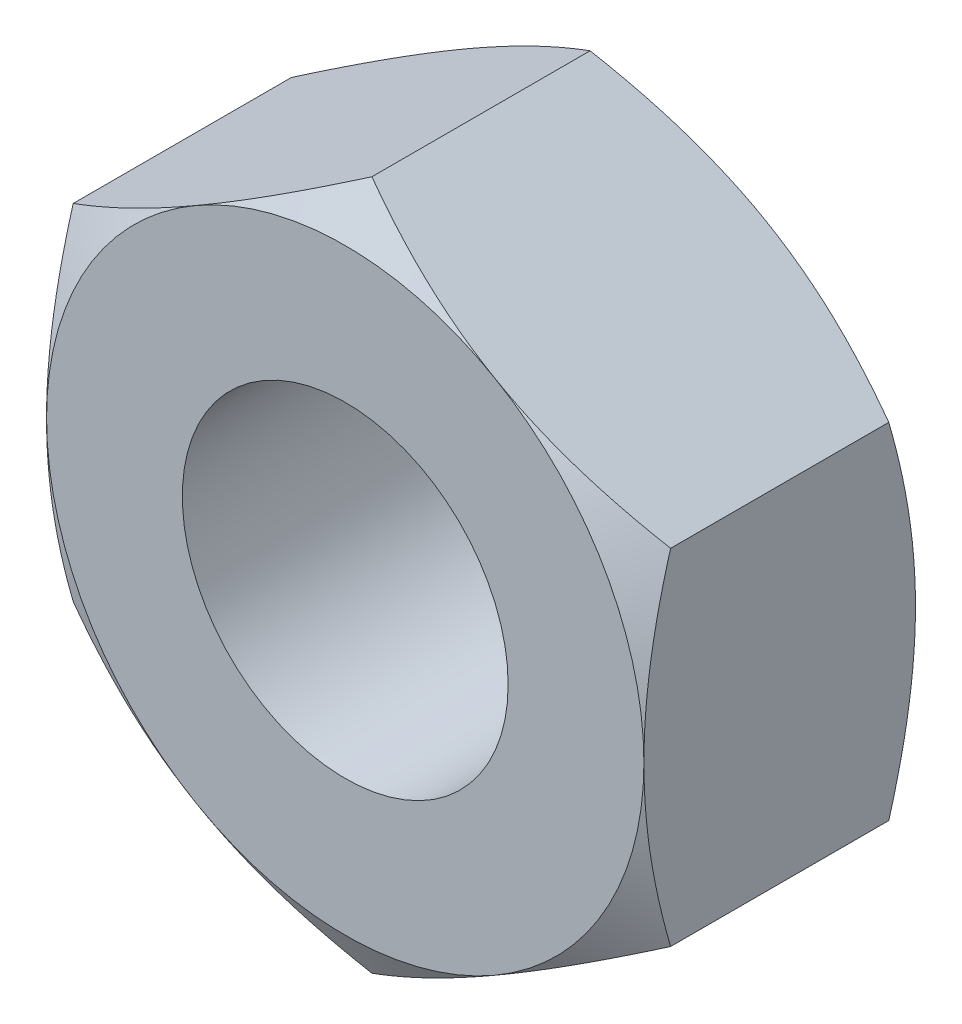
ISO-10303-21;
HEADER;
FILE_DESCRIPTION(('STEP AP214'),'2;1');
FILE_NAME('part.step','',(''),(''),'','','');
FILE_SCHEMA(('AUTOMOTIVE_DESIGN { 1 0 10303 214 1 1 1 1 }'));
ENDSEC;
DATA;
#1=APPLICATION_CONTEXT('core data for automotive mechanical design processes');
#2=APPLICATION_PROTOCOL_DEFINITION('international standard','automotive_design',2000,#1);
#3=PRODUCT_CONTEXT('',#1,'mechanical');
#4=PRODUCT('Part','Part','',(#3));
#5=PRODUCT_RELATED_PRODUCT_CATEGORY('part','',(#4));
#6=PRODUCT_DEFINITION_FORMATION('','',#4);
#7=PRODUCT_DEFINITION_CONTEXT('part definition',#1,'design');
#8=PRODUCT_DEFINITION('design','',#6,#7);
#9=PRODUCT_DEFINITION_SHAPE('','',#8);
#10=(LENGTH_UNIT() NAMED_UNIT(*) SI_UNIT(.MILLI.,.METRE.));
#11=(NAMED_UNIT(*) PLANE_ANGLE_UNIT() SI_UNIT($,.RADIAN.));
#12=(NAMED_UNIT(*) SI_UNIT($,.STERADIAN.) SOLID_ANGLE_UNIT());
#13=UNCERTAINTY_MEASURE_WITH_UNIT(LENGTH_MEASURE(1.E-05),#10,'distance_accuracy_value','');
#14=(GEOMETRIC_REPRESENTATION_CONTEXT(3) GLOBAL_UNCERTAINTY_ASSIGNED_CONTEXT((#13)) GLOBAL_UNIT_ASSIGNED_CONTEXT((#10,
#11,#12)) REPRESENTATION_CONTEXT('',''));
#15=CARTESIAN_POINT('',(0.,0.,0.));
#16=DIRECTION('',(0.,0.,1.));
#17=DIRECTION('',(1.,0.,0.));
#18=AXIS2_PLACEMENT_3D('',#15,#16,#17);
#19=CARTESIAN_POINT('',(-5.50000000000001,9.52627944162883,0.));
#20=DIRECTION('',(0.,0.,-1.));
#21=DIRECTION('',(-1.,0.,0.));
#22=AXIS2_PLACEMENT_3D('',#19,#20,#21);
#23=PLANE('',#22);
#24=CARTESIAN_POINT('',(0.,0.,0.));
#25=DIRECTION('',(0.,0.,1.));
#26=DIRECTION('',(1.,0.,0.));
#27=AXIS2_PLACEMENT_3D('',#24,#25,#26);
#28=CIRCLE('',#27,3.);
#29=CARTESIAN_POINT('',(3.,0.,0.));
#30=VERTEX_POINT('',#29);
#31=EDGE_CURVE('E312',#30,#30,#28,.T.);
#32=ORIENTED_EDGE('',*,*,#31,.F.);
#33=EDGE_LOOP('',(#32));
#34=FACE_BOUND('',#33,.T.);
#35=CARTESIAN_POINT('',(0.,0.,0.));
#36=DIRECTION('',(0.,0.,-1.));
#37=DIRECTION('',(-1.,0.,0.));
#38=AXIS2_PLACEMENT_3D('',#35,#36,#37);
#39=CIRCLE('',#38,5.5);
#40=CARTESIAN_POINT('',(-5.50000000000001,0.,0.));
#41=VERTEX_POINT('',#40);
#42=CARTESIAN_POINT('',(-2.75,4.76313972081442,0.));
#43=VERTEX_POINT('',#42);
#44=EDGE_CURVE('E320',#41,#43,#39,.T.);
#45=ORIENTED_EDGE('',*,*,#44,.F.);
#46=CARTESIAN_POINT('',(0.,0.,0.));
#47=DIRECTION('',(0.,0.,-1.));
#48=DIRECTION('',(-1.,0.,0.));
#49=AXIS2_PLACEMENT_3D('',#46,#47,#48);
#50=CIRCLE('',#49,5.5);
#51=CARTESIAN_POINT('',(-2.75,-4.76313972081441,0.));
#52=VERTEX_POINT('',#51);
#53=EDGE_CURVE('E141',#41,#52,#50,.F.);
#54=ORIENTED_EDGE('',*,*,#53,.T.);
#55=CARTESIAN_POINT('',(2.75,-4.76313972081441,0.));
#56=VERTEX_POINT('',#55);
#57=EDGE_CURVE('E243',#52,#56,#50,.F.);
#58=ORIENTED_EDGE('',*,*,#57,.T.);
#59=CARTESIAN_POINT('',(5.50000000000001,0.,0.));
#60=VERTEX_POINT('',#59);
#61=EDGE_CURVE('E144',#56,#60,#50,.F.);
#62=ORIENTED_EDGE('',*,*,#61,.T.);
#63=CARTESIAN_POINT('',(2.75,4.76313972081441,0.));
#64=VERTEX_POINT('',#63);
#65=EDGE_CURVE('E119',#60,#64,#50,.F.);
#66=ORIENTED_EDGE('',*,*,#65,.T.);
#67=EDGE_CURVE('E132',#64,#43,#50,.F.);
#68=ORIENTED_EDGE('',*,*,#67,.T.);
#69=EDGE_LOOP('',(#45,#54,#58,#62,#66,#68));
#70=FACE_BOUND('',#69,.T.);
#71=ADVANCED_FACE('F24',(#34,#70),#23,.F.);
#72=CARTESIAN_POINT('',(0.,0.,0.));
#73=DIRECTION('',(0.,0.,-1.));
#74=DIRECTION('',(-1.,0.,0.));
#75=AXIS2_PLACEMENT_3D('',#72,#73,#74);
#76=CONICAL_SURFACE('',#75,5.5,1.0471975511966);
#77=CARTESIAN_POINT('',(-5.50000000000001,-8.70351799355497,-2.76879271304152));
#78=CARTESIAN_POINT('',(-5.50000000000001,-8.46178904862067,-2.65084369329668));
#79=CARTESIAN_POINT('',(-5.50000000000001,-8.21952354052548,-2.5339763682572));
#80=CARTESIAN_POINT('',(-5.50000000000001,-7.73363470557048,-2.30301016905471));
#81=CARTESIAN_POINT('',(-5.50000000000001,-7.49001118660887,-2.18891169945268));
#82=CARTESIAN_POINT('',(-5.50000000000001,-6.99994766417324,-1.96355080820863));
#83=CARTESIAN_POINT('',(-5.50000000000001,-6.75349963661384,-1.85230577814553));
#84=CARTESIAN_POINT('',(-5.50000000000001,-6.2587033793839,-1.63414148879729));
#85=CARTESIAN_POINT('',(-5.50000000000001,-6.01035523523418,-1.52722203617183));
#86=CARTESIAN_POINT('',(-5.50000000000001,-5.50269627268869,-1.31522542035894));
#87=CARTESIAN_POINT('',(-5.50000000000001,-5.24330438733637,-1.21034137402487));
#88=CARTESIAN_POINT('',(-5.50000000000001,-4.72155044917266,-1.00809836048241));
#89=CARTESIAN_POINT('',(-5.50000000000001,-4.45918807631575,-0.910740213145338));
#90=CARTESIAN_POINT('',(-5.50000000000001,-3.93151422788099,-0.725978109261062));
#91=CARTESIAN_POINT('',(-5.50000000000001,-3.666209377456,-0.638555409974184));
#92=CARTESIAN_POINT('',(-5.50000000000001,-3.13179456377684,-0.476354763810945));
#93=CARTESIAN_POINT('',(-5.50000000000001,-2.8626857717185,-0.401573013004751));
#94=CARTESIAN_POINT('',(-5.50000000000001,-2.3220590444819,-0.268532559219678));
#95=CARTESIAN_POINT('',(-5.50000000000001,-2.05056513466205,-0.210177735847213));
#96=CARTESIAN_POINT('',(-5.50000000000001,-1.50398696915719,-0.113169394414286));
#97=CARTESIAN_POINT('',(-5.50000000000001,-1.22890310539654,-0.0745137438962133));
#98=CARTESIAN_POINT('',(-5.50000000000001,-0.816510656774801,-0.0338614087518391));
#99=CARTESIAN_POINT('',(-5.50000000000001,-0.680022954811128,-0.0232143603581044));
#100=CARTESIAN_POINT('',(-5.50000000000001,-0.406723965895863,-0.00770408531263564));
#101=CARTESIAN_POINT('',(-5.50000000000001,-0.269912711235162,-0.00284030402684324));
#102=CARTESIAN_POINT('',(-5.50000000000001,0.00380270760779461,0.000982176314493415));
#103=CARTESIAN_POINT('',(-5.50000000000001,0.140706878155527,-5.95812088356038E-05));
#104=CARTESIAN_POINT('',(-5.50000000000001,0.414334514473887,-0.00802004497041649));
#105=CARTESIAN_POINT('',(-5.50000000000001,0.551057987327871,-0.0149385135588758));
#106=CARTESIAN_POINT('',(-5.50000000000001,0.874535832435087,-0.0381092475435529));
#107=CARTESIAN_POINT('',(-5.50000000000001,1.06111508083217,-0.0568653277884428));
#108=CARTESIAN_POINT('',(-5.50000000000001,1.43299199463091,-0.104336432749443));
#109=CARTESIAN_POINT('',(-5.50000000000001,1.61828950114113,-0.133052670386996));
#110=CARTESIAN_POINT('',(-5.50000000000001,2.1719900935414,-0.23262759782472));
#111=CARTESIAN_POINT('',(-5.50000000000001,2.53801909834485,-0.316897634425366));
#112=CARTESIAN_POINT('',(-5.50000000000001,3.08556978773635,-0.46434516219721));
#113=CARTESIAN_POINT('',(-5.50000000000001,3.26989484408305,-0.51772313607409));
#114=CARTESIAN_POINT('',(-5.50000000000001,3.63675886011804,-0.630354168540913));
#115=CARTESIAN_POINT('',(-5.50000000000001,3.81929780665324,-0.689607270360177));
#116=CARTESIAN_POINT('',(-5.50000000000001,4.1826407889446,-0.813010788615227));
#117=CARTESIAN_POINT('',(-5.50000000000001,4.3634452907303,-0.877159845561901));
#118=CARTESIAN_POINT('',(-5.50000000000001,4.72353439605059,-1.00956774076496));
#119=CARTESIAN_POINT('',(-5.50000000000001,4.90281902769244,-1.07782650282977));
#120=CARTESIAN_POINT('',(-5.50000000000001,5.3614641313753,-1.25751437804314));
#121=CARTESIAN_POINT('',(-5.50000000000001,5.63984228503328,-1.37144768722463));
#122=CARTESIAN_POINT('',(-5.50000000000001,6.19388947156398,-1.60574322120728));
#123=CARTESIAN_POINT('',(-5.50000000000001,6.46955825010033,-1.72610604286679));
#124=CARTESIAN_POINT('',(-5.50000000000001,7.01875943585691,-1.97183385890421));
#125=CARTESIAN_POINT('',(-5.50000000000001,7.29229110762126,-2.09720049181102));
#126=CARTESIAN_POINT('',(-5.50000000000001,7.83752606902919,-2.35181333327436));
#127=CARTESIAN_POINT('',(-5.50000000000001,8.10922941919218,-2.481059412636));
#128=CARTESIAN_POINT('',(-5.50000000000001,8.65153958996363,-2.74282128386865));
#129=CARTESIAN_POINT('',(-5.50000000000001,8.92214424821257,-2.87534154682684));
#130=CARTESIAN_POINT('',(-5.50000000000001,9.46212230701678,-3.14286981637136));
#131=CARTESIAN_POINT('',(-5.50000000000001,9.73149569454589,-3.27787784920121));
#132=CARTESIAN_POINT('',(-5.50000000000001,10.5379884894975,-3.68585796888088));
#133=CARTESIAN_POINT('',(-5.50000000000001,11.0735860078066,-3.96183747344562));
#134=CARTESIAN_POINT('',(-5.50000000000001,12.0898316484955,-4.49207617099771));
#135=CARTESIAN_POINT('',(-5.50000000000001,12.5707451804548,-4.7458291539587));
#136=CARTESIAN_POINT('',(-5.50000000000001,13.5308468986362,-5.25663670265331));
#137=CARTESIAN_POINT('',(-5.50000000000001,14.0100349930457,-5.51369144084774));
#138=CARTESIAN_POINT('',(-5.50000000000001,14.9655711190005,-6.02945598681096));
#139=CARTESIAN_POINT('',(-5.50000000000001,15.4419233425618,-6.28815804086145));
#140=CARTESIAN_POINT('',(-5.50000000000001,16.3935427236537,-6.80747025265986));
#141=CARTESIAN_POINT('',(-5.50000000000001,16.8688099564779,-7.06808027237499));
#142=CARTESIAN_POINT('',(-5.50000000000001,17.343689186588,-7.32939074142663));
#143=B_SPLINE_CURVE_WITH_KNOTS('',3,(#77,#78,#79,#80,#81,#82,#83,#84,#85,#86,#87,#88,#89,#90,
#91,#92,#93,#94,#95,#96,#97,#98,#99,#100,#101,#102,#103,#104,#105,#106,#107,#108,#109,#110,#111,
#112,#113,#114,#115,#116,#117,#118,#119,#120,#121,#122,#123,#124,#125,#126,#127,#128,#129,#130,
#131,#132,#133,#134,#135,#136,#137,#138,#139,#140,#141,#142),.UNSPECIFIED.,.F.,.F.,(4,2,2,2,2,2,
2,2,2,2,2,2,2,2,2,2,2,2,2,2,2,2,2,2,2,2,2,2,2,2,2,2,4),(0.,0.806919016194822,1.61395523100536,
2.42509926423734,3.23620700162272,4.07549945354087,4.91488320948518,5.7526562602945,
6.59017675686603,7.42268958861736,8.25511228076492,8.66571545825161,9.07627925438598,
9.48687479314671,9.89745372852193,10.4596985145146,11.0220117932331,12.1471841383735,
12.7228259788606,13.2984720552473,13.873958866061,14.4494350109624,15.3516919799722,
16.2540328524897,17.1566716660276,18.0592804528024,18.9631985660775,19.8671262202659,
21.6746295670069,23.3058782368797,24.937212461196,26.5634131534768,28.1894973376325),.UNSPECIFIED.);
#144=CARTESIAN_POINT('',(-5.50000000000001,3.17542648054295,-0.491240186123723));
#145=VERTEX_POINT('',#144);
#146=EDGE_CURVE('E149',#145,#41,#143,.F.);
#147=ORIENTED_EDGE('',*,*,#146,.T.);
#148=ORIENTED_EDGE('',*,*,#44,.T.);
#149=CARTESIAN_POINT('',(0.000200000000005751,6.35096843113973,-0.491306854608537));
#150=CARTESIAN_POINT('',(-0.120696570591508,6.28116876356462,-0.451013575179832));
#151=CARTESIAN_POINT('',(-0.2420439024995,6.21110884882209,-0.412548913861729));
#152=CARTESIAN_POINT('',(-0.485724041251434,6.0704200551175,-0.3397804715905));
#153=CARTESIAN_POINT('',(-0.608057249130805,5.99979094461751,-0.305478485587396));
#154=CARTESIAN_POINT('',(-0.977015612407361,5.78677273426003,-0.209489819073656));
#155=CARTESIAN_POINT('',(-1.2250971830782,5.64354277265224,-0.154892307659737));
#156=CARTESIAN_POINT('',(-1.59634674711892,5.42920173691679,-0.0908698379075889));
#157=CARTESIAN_POINT('',(-1.71840546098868,5.35873110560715,-0.0726315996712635));
#158=CARTESIAN_POINT('',(-1.96307442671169,5.21747141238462,-0.0420485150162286));
#159=CARTESIAN_POINT('',(-2.08568462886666,5.14668237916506,-0.0297031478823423));
#160=CARTESIAN_POINT('',(-2.3311179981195,5.00498135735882,-0.0112204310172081));
#161=CARTESIAN_POINT('',(-2.45394076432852,4.93406960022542,-0.00507603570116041));
#162=CARTESIAN_POINT('',(-2.6996929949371,4.7921844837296,0.000879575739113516));
#163=CARTESIAN_POINT('',(-2.82262245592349,4.72121112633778,0.000690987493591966));
#164=CARTESIAN_POINT('',(-3.15941408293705,4.52676438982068,-0.00853091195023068));
#165=CARTESIAN_POINT('',(-3.37316601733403,4.40335465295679,-0.0240139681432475));
#166=CARTESIAN_POINT('',(-3.79925015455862,4.15735486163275,-0.0731121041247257));
#167=CARTESIAN_POINT('',(-4.01158085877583,4.03476567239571,-0.106743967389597));
#168=CARTESIAN_POINT('',(-4.43852257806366,3.7882707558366,-0.190814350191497));
#169=CARTESIAN_POINT('',(-4.65307971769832,3.66439613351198,-0.241609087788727));
#170=CARTESIAN_POINT('',(-5.07899423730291,3.4184942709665,-0.356892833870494));
#171=CARTESIAN_POINT('',(-5.29035707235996,3.29646388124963,-0.421354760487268));
#172=CARTESIAN_POINT('',(-5.50020000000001,3.17531101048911,-0.491306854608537));
#173=B_SPLINE_CURVE_WITH_KNOTS('',3,(#149,#150,#151,#152,#153,#154,#155,#156,#157,#158,#159,
#160,#161,#162,#163,#164,#165,#166,#167,#168,#169,#170,#171,#172),.UNSPECIFIED.,.F.,.F.,(4,2,2,
2,2,2,2,2,2,2,2,4),(0.,0.435859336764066,0.871905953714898,1.74581116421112,2.17206086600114,
2.59827289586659,3.02400011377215,3.44971418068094,4.19085033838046,4.93267305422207,
5.69094899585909,6.44773620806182),.UNSPECIFIED.);
#174=EDGE_CURVE('E181',#43,#145,#173,.T.);
#175=ORIENTED_EDGE('',*,*,#174,.T.);
#176=EDGE_LOOP('',(#147,#148,#175));
#177=FACE_BOUND('',#176,.T.);
#178=ADVANCED_FACE('F168',(#177),#76,.T.);
#179=CARTESIAN_POINT('',(5.50020000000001,3.17531101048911,-0.491306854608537));
#180=CARTESIAN_POINT('',(5.37930342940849,3.24511067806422,-0.451013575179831));
#181=CARTESIAN_POINT('',(5.2579560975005,3.31517059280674,-0.412548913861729));
#182=CARTESIAN_POINT('',(5.01427595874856,3.45585938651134,-0.339780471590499));
#183=CARTESIAN_POINT('',(4.89194275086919,3.52648849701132,-0.305478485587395));
#184=CARTESIAN_POINT('',(4.52298438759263,3.73950670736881,-0.209489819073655));
#185=CARTESIAN_POINT('',(4.27490281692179,3.88273666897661,-0.154892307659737));
#186=CARTESIAN_POINT('',(3.90365325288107,4.09707770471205,-0.0908698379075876));
#187=CARTESIAN_POINT('',(3.78159453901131,4.16754833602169,-0.072631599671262));
#188=CARTESIAN_POINT('',(3.53692557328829,4.30880802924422,-0.042048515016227));
#189=CARTESIAN_POINT('',(3.41431537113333,4.37959706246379,-0.0297031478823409));
#190=CARTESIAN_POINT('',(3.16888200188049,4.52129808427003,-0.0112204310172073));
#191=CARTESIAN_POINT('',(3.04605923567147,4.59220984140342,-0.00507603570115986));
#192=CARTESIAN_POINT('',(2.80030700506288,4.73409495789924,0.000879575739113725));
#193=CARTESIAN_POINT('',(2.67737754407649,4.80506831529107,0.000690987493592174));
#194=CARTESIAN_POINT('',(2.34058591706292,4.99951505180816,-0.00853091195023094));
#195=CARTESIAN_POINT('',(2.12683398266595,5.12292478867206,-0.0240139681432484));
#196=CARTESIAN_POINT('',(1.70074984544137,5.3689245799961,-0.0731121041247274));
#197=CARTESIAN_POINT('',(1.48841914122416,5.49151376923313,-0.106743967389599));
#198=CARTESIAN_POINT('',(1.06147742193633,5.73800868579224,-0.190814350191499));
#199=CARTESIAN_POINT('',(0.846920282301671,5.86188330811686,-0.241609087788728));
#200=CARTESIAN_POINT('',(0.421005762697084,6.10778517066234,-0.356892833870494));
#201=CARTESIAN_POINT('',(0.209642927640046,6.22981556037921,-0.421354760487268));
#202=CARTESIAN_POINT('',(-0.000200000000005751,6.35096843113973,-0.491306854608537));
#203=B_SPLINE_CURVE_WITH_KNOTS('',3,(#179,#180,#181,#182,#183,#184,#185,#186,#187,#188,#189,
#190,#191,#192,#193,#194,#195,#196,#197,#198,#199,#200,#201,#202),.UNSPECIFIED.,.F.,.F.,(4,2,2,
2,2,2,2,2,2,2,2,4),(0.,0.435859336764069,0.871905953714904,1.74581116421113,2.17206086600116,
2.59827289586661,3.02400011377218,3.44971418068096,4.19085033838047,4.93267305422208,
5.6909489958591,6.44773620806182),.UNSPECIFIED.);
#204=CARTESIAN_POINT('',(0.,6.35085296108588,-0.491240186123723));
#205=VERTEX_POINT('',#204);
#206=EDGE_CURVE('E128',#64,#205,#203,.T.);
#207=ORIENTED_EDGE('',*,*,#206,.T.);
#208=EDGE_CURVE('E135',#205,#43,#173,.T.);
#209=ORIENTED_EDGE('',*,*,#208,.T.);
#210=ORIENTED_EDGE('',*,*,#67,.F.);
#211=EDGE_LOOP('',(#207,#209,#210));
#212=FACE_BOUND('',#211,.T.);
#213=ADVANCED_FACE('F133',(#212),#76,.T.);
#214=CARTESIAN_POINT('',(5.50000000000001,-8.70351799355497,-2.76879271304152));
#215=CARTESIAN_POINT('',(5.50000000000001,-8.46178904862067,-2.65084369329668));
#216=CARTESIAN_POINT('',(5.50000000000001,-8.21952354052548,-2.5339763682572));
#217=CARTESIAN_POINT('',(5.50000000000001,-7.73363470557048,-2.30301016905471));
#218=CARTESIAN_POINT('',(5.50000000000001,-7.49001118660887,-2.18891169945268));
#219=CARTESIAN_POINT('',(5.50000000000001,-6.99994766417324,-1.96355080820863));
#220=CARTESIAN_POINT('',(5.50000000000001,-6.75349963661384,-1.85230577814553));
#221=CARTESIAN_POINT('',(5.50000000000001,-6.2587033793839,-1.63414148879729));
#222=CARTESIAN_POINT('',(5.50000000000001,-6.01035523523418,-1.52722203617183));
#223=CARTESIAN_POINT('',(5.50000000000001,-5.50269627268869,-1.31522542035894));
#224=CARTESIAN_POINT('',(5.50000000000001,-5.24330438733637,-1.21034137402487));
#225=CARTESIAN_POINT('',(5.50000000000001,-4.72155044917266,-1.00809836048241));
#226=CARTESIAN_POINT('',(5.50000000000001,-4.45918807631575,-0.910740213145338));
#227=CARTESIAN_POINT('',(5.50000000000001,-3.93151422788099,-0.725978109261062));
#228=CARTESIAN_POINT('',(5.50000000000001,-3.666209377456,-0.638555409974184));
#229=CARTESIAN_POINT('',(5.50000000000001,-3.13179456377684,-0.476354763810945));
#230=CARTESIAN_POINT('',(5.50000000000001,-2.8626857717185,-0.401573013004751));
#231=CARTESIAN_POINT('',(5.50000000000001,-2.3220590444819,-0.268532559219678));
#232=CARTESIAN_POINT('',(5.50000000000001,-2.05056513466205,-0.210177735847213));
#233=CARTESIAN_POINT('',(5.50000000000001,-1.50398696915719,-0.113169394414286));
#234=CARTESIAN_POINT('',(5.50000000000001,-1.22890310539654,-0.0745137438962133));
#235=CARTESIAN_POINT('',(5.50000000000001,-0.816510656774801,-0.0338614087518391));
#236=CARTESIAN_POINT('',(5.50000000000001,-0.680022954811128,-0.0232143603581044));
#237=CARTESIAN_POINT('',(5.50000000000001,-0.406723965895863,-0.00770408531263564));
#238=CARTESIAN_POINT('',(5.50000000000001,-0.269912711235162,-0.00284030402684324));
#239=CARTESIAN_POINT('',(5.50000000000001,0.00380270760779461,0.000982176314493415));
#240=CARTESIAN_POINT('',(5.50000000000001,0.140706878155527,-5.95812088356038E-05));
#241=CARTESIAN_POINT('',(5.50000000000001,0.414334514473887,-0.00802004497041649));
#242=CARTESIAN_POINT('',(5.50000000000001,0.551057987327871,-0.0149385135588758));
#243=CARTESIAN_POINT('',(5.50000000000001,0.874535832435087,-0.0381092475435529));
#244=CARTESIAN_POINT('',(5.50000000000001,1.06111508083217,-0.0568653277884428));
#245=CARTESIAN_POINT('',(5.50000000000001,1.43299199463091,-0.104336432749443));
#246=CARTESIAN_POINT('',(5.50000000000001,1.61828950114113,-0.133052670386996));
#247=CARTESIAN_POINT('',(5.50000000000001,2.1719900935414,-0.23262759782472));
#248=CARTESIAN_POINT('',(5.50000000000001,2.53801909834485,-0.316897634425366));
#249=CARTESIAN_POINT('',(5.50000000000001,3.08556978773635,-0.46434516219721));
#250=CARTESIAN_POINT('',(5.50000000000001,3.26989484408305,-0.51772313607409));
#251=CARTESIAN_POINT('',(5.50000000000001,3.63675886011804,-0.630354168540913));
#252=CARTESIAN_POINT('',(5.50000000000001,3.81929780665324,-0.689607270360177));
#253=CARTESIAN_POINT('',(5.50000000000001,4.1826407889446,-0.813010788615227));
#254=CARTESIAN_POINT('',(5.50000000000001,4.3634452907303,-0.877159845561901));
#255=CARTESIAN_POINT('',(5.50000000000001,4.72353439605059,-1.00956774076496));
#256=CARTESIAN_POINT('',(5.50000000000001,4.90281902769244,-1.07782650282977));
#257=CARTESIAN_POINT('',(5.50000000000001,5.3614641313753,-1.25751437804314));
#258=CARTESIAN_POINT('',(5.50000000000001,5.63984228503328,-1.37144768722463));
#259=CARTESIAN_POINT('',(5.50000000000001,6.19388947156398,-1.60574322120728));
#260=CARTESIAN_POINT('',(5.50000000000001,6.46955825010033,-1.72610604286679));
#261=CARTESIAN_POINT('',(5.50000000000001,7.01875943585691,-1.97183385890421));
#262=CARTESIAN_POINT('',(5.50000000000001,7.29229110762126,-2.09720049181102));
#263=CARTESIAN_POINT('',(5.50000000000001,7.83752606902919,-2.35181333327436));
#264=CARTESIAN_POINT('',(5.50000000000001,8.10922941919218,-2.481059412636));
#265=CARTESIAN_POINT('',(5.50000000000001,8.65153958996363,-2.74282128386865));
#266=CARTESIAN_POINT('',(5.50000000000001,8.92214424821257,-2.87534154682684));
#267=CARTESIAN_POINT('',(5.50000000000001,9.46212230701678,-3.14286981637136));
#268=CARTESIAN_POINT('',(5.50000000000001,9.73149569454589,-3.27787784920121));
#269=CARTESIAN_POINT('',(5.50000000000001,10.5379884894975,-3.68585796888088));
#270=CARTESIAN_POINT('',(5.50000000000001,11.0735860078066,-3.96183747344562));
#271=CARTESIAN_POINT('',(5.50000000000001,12.0898316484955,-4.49207617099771));
#272=CARTESIAN_POINT('',(5.50000000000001,12.5707451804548,-4.7458291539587));
#273=CARTESIAN_POINT('',(5.50000000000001,13.5308468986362,-5.25663670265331));
#274=CARTESIAN_POINT('',(5.50000000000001,14.0100349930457,-5.51369144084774));
#275=CARTESIAN_POINT('',(5.50000000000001,14.9655711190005,-6.02945598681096));
#276=CARTESIAN_POINT('',(5.50000000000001,15.4419233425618,-6.28815804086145));
#277=CARTESIAN_POINT('',(5.50000000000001,16.3935427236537,-6.80747025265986));
#278=CARTESIAN_POINT('',(5.50000000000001,16.8688099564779,-7.06808027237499));
#279=CARTESIAN_POINT('',(5.50000000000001,17.343689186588,-7.32939074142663));
#280=B_SPLINE_CURVE_WITH_KNOTS('',3,(#214,#215,#216,#217,#218,#219,#220,#221,#222,#223,#224,
#225,#226,#227,#228,#229,#230,#231,#232,#233,#234,#235,#236,#237,#238,#239,#240,#241,#242,#243,
#244,#245,#246,#247,#248,#249,#250,#251,#252,#253,#254,#255,#256,#257,#258,#259,#260,#261,#262,
#263,#264,#265,#266,#267,#268,#269,#270,#271,#272,#273,#274,#275,#276,#277,#278,#279),
.UNSPECIFIED.,.F.,.F.,(4,2,2,2,2,2,2,2,2,2,2,2,2,2,2,2,2,2,2,2,2,2,2,2,2,2,2,2,2,2,2,2,4),(0.,
0.806919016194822,1.61395523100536,2.42509926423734,3.23620700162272,4.07549945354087,
4.91488320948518,5.7526562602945,6.59017675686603,7.42268958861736,8.25511228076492,
8.66571545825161,9.07627925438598,9.48687479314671,9.89745372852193,10.4596985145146,
11.0220117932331,12.1471841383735,12.7228259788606,13.2984720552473,13.873958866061,
14.4494350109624,15.3516919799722,16.2540328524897,17.1566716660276,18.0592804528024,
18.9631985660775,19.8671262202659,21.6746295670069,23.3058782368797,24.937212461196,
26.5634131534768,28.1894973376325),.UNSPECIFIED.);
#281=CARTESIAN_POINT('',(5.50000000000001,3.17542648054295,-0.491240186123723));
#282=VERTEX_POINT('',#281);
#283=EDGE_CURVE('E122',#60,#282,#280,.T.);
#284=ORIENTED_EDGE('',*,*,#283,.T.);
#285=EDGE_CURVE('E115',#282,#64,#203,.T.);
#286=ORIENTED_EDGE('',*,*,#285,.T.);
#287=ORIENTED_EDGE('',*,*,#65,.F.);
#288=EDGE_LOOP('',(#284,#286,#287));
#289=FACE_BOUND('',#288,.T.);
#290=ADVANCED_FACE('F117',(#289),#76,.T.);
#291=CARTESIAN_POINT('',(-0.000200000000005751,-6.35096843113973,-0.491306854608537));
#292=CARTESIAN_POINT('',(0.120696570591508,-6.28116876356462,-0.451013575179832));
#293=CARTESIAN_POINT('',(0.2420439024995,-6.21110884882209,-0.412548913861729));
#294=CARTESIAN_POINT('',(0.485724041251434,-6.0704200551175,-0.3397804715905));
#295=CARTESIAN_POINT('',(0.608057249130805,-5.99979094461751,-0.305478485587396));
#296=CARTESIAN_POINT('',(0.977015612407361,-5.78677273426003,-0.209489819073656));
#297=CARTESIAN_POINT('',(1.2250971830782,-5.64354277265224,-0.154892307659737));
#298=CARTESIAN_POINT('',(1.59634674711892,-5.42920173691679,-0.0908698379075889));
#299=CARTESIAN_POINT('',(1.71840546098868,-5.35873110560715,-0.0726315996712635));
#300=CARTESIAN_POINT('',(1.96307442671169,-5.21747141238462,-0.0420485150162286));
#301=CARTESIAN_POINT('',(2.08568462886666,-5.14668237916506,-0.0297031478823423));
#302=CARTESIAN_POINT('',(2.3311179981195,-5.00498135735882,-0.0112204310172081));
#303=CARTESIAN_POINT('',(2.45394076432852,-4.93406960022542,-0.00507603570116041));
#304=CARTESIAN_POINT('',(2.6996929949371,-4.7921844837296,0.000879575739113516));
#305=CARTESIAN_POINT('',(2.82262245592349,-4.72121112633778,0.000690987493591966));
#306=CARTESIAN_POINT('',(3.15941408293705,-4.52676438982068,-0.00853091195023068));
#307=CARTESIAN_POINT('',(3.37316601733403,-4.40335465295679,-0.0240139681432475));
#308=CARTESIAN_POINT('',(3.79925015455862,-4.15735486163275,-0.0731121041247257));
#309=CARTESIAN_POINT('',(4.01158085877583,-4.03476567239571,-0.106743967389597));
#310=CARTESIAN_POINT('',(4.43852257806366,-3.7882707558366,-0.190814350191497));
#311=CARTESIAN_POINT('',(4.65307971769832,-3.66439613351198,-0.241609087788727));
#312=CARTESIAN_POINT('',(5.07899423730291,-3.4184942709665,-0.356892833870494));
#313=CARTESIAN_POINT('',(5.29035707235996,-3.29646388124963,-0.421354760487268));
#314=CARTESIAN_POINT('',(5.50020000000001,-3.17531101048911,-0.491306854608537));
#315=B_SPLINE_CURVE_WITH_KNOTS('',3,(#291,#292,#293,#294,#295,#296,#297,#298,#299,#300,#301,
#302,#303,#304,#305,#306,#307,#308,#309,#310,#311,#312,#313,#314),.UNSPECIFIED.,.F.,.F.,(4,2,2,
2,2,2,2,2,2,2,2,4),(0.,0.435859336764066,0.871905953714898,1.74581116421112,2.17206086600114,
2.59827289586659,3.02400011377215,3.44971418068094,4.19085033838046,4.93267305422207,
5.69094899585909,6.44773620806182),.UNSPECIFIED.);
#316=CARTESIAN_POINT('',(5.50000000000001,-3.17542648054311,-0.491240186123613));
#317=VERTEX_POINT('',#316);
#318=EDGE_CURVE('E195',#56,#317,#315,.T.);
#319=ORIENTED_EDGE('',*,*,#318,.T.);
#320=EDGE_CURVE('E194',#317,#60,#280,.T.);
#321=ORIENTED_EDGE('',*,*,#320,.T.);
#322=ORIENTED_EDGE('',*,*,#61,.F.);
#323=EDGE_LOOP('',(#319,#321,#322));
#324=FACE_BOUND('',#323,.T.);
#325=ADVANCED_FACE('F370',(#324),#76,.T.);
#326=CARTESIAN_POINT('',(0.,-6.35085296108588,-0.491240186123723));
#327=VERTEX_POINT('',#326);
#328=EDGE_CURVE('E253',#327,#56,#315,.T.);
#329=ORIENTED_EDGE('',*,*,#328,.T.);
#330=ORIENTED_EDGE('',*,*,#57,.F.);
#331=CARTESIAN_POINT('',(-5.50020000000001,-3.17531101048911,-0.491306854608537));
#332=CARTESIAN_POINT('',(-5.37930342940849,-3.24511067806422,-0.451013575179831));
#333=CARTESIAN_POINT('',(-5.2579560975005,-3.31517059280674,-0.412548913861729));
#334=CARTESIAN_POINT('',(-5.01427595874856,-3.45585938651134,-0.339780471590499));
#335=CARTESIAN_POINT('',(-4.89194275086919,-3.52648849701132,-0.305478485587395));
#336=CARTESIAN_POINT('',(-4.52298438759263,-3.73950670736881,-0.209489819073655));
#337=CARTESIAN_POINT('',(-4.27490281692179,-3.88273666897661,-0.154892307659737));
#338=CARTESIAN_POINT('',(-3.90365325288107,-4.09707770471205,-0.0908698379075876));
#339=CARTESIAN_POINT('',(-3.78159453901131,-4.16754833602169,-0.072631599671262));
#340=CARTESIAN_POINT('',(-3.53692557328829,-4.30880802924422,-0.042048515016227));
#341=CARTESIAN_POINT('',(-3.41431537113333,-4.37959706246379,-0.0297031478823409));
#342=CARTESIAN_POINT('',(-3.16888200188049,-4.52129808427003,-0.0112204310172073));
#343=CARTESIAN_POINT('',(-3.04605923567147,-4.59220984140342,-0.00507603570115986));
#344=CARTESIAN_POINT('',(-2.80030700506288,-4.73409495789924,0.000879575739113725));
#345=CARTESIAN_POINT('',(-2.67737754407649,-4.80506831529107,0.000690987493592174));
#346=CARTESIAN_POINT('',(-2.34058591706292,-4.99951505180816,-0.00853091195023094));
#347=CARTESIAN_POINT('',(-2.12683398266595,-5.12292478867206,-0.0240139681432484));
#348=CARTESIAN_POINT('',(-1.70074984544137,-5.3689245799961,-0.0731121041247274));
#349=CARTESIAN_POINT('',(-1.48841914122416,-5.49151376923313,-0.106743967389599));
#350=CARTESIAN_POINT('',(-1.06147742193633,-5.73800868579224,-0.190814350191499));
#351=CARTESIAN_POINT('',(-0.846920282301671,-5.86188330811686,-0.241609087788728));
#352=CARTESIAN_POINT('',(-0.421005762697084,-6.10778517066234,-0.356892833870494));
#353=CARTESIAN_POINT('',(-0.209642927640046,-6.22981556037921,-0.421354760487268));
#354=CARTESIAN_POINT('',(0.000200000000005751,-6.35096843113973,-0.491306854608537));
#355=B_SPLINE_CURVE_WITH_KNOTS('',3,(#331,#332,#333,#334,#335,#336,#337,#338,#339,#340,#341,
#342,#343,#344,#345,#346,#347,#348,#349,#350,#351,#352,#353,#354),.UNSPECIFIED.,.F.,.F.,(4,2,2,
2,2,2,2,2,2,2,2,4),(0.,0.435859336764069,0.871905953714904,1.74581116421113,2.17206086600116,
2.59827289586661,3.02400011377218,3.44971418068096,4.19085033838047,4.93267305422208,
5.6909489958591,6.44773620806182),.UNSPECIFIED.);
#356=EDGE_CURVE('E257',#52,#327,#355,.T.);
#357=ORIENTED_EDGE('',*,*,#356,.T.);
#358=EDGE_LOOP('',(#329,#330,#357));
#359=FACE_BOUND('',#358,.T.);
#360=ADVANCED_FACE('F174',(#359),#76,.T.);
#361=CARTESIAN_POINT('',(-5.50000000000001,-3.17542648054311,-0.491240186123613));
#362=VERTEX_POINT('',#361);
#363=EDGE_CURVE('E162',#362,#52,#355,.T.);
#364=ORIENTED_EDGE('',*,*,#363,.T.);
#365=ORIENTED_EDGE('',*,*,#53,.F.);
#366=EDGE_CURVE('E127',#41,#362,#143,.F.);
#367=ORIENTED_EDGE('',*,*,#366,.T.);
#368=EDGE_LOOP('',(#364,#365,#367));
#369=FACE_BOUND('',#368,.T.);
#370=ADVANCED_FACE('F262',(#369),#76,.T.);
#371=CARTESIAN_POINT('',(5.50000000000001,3.17542648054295,-5.));
#372=DIRECTION('',(0.5,0.866025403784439,0.));
#373=DIRECTION('',(-0.866025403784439,0.5,0.));
#374=AXIS2_PLACEMENT_3D('',#371,#372,#373);
#375=PLANE('',#374);
#376=CARTESIAN_POINT('',(-0.000200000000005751,6.35096843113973,-4.50869314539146));
#377=CARTESIAN_POINT('',(0.120696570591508,6.28116876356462,-4.54898642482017));
#378=CARTESIAN_POINT('',(0.2420439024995,6.21110884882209,-4.58745108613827));
#379=CARTESIAN_POINT('',(0.485724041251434,6.0704200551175,-4.6602195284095));
#380=CARTESIAN_POINT('',(0.608057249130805,5.99979094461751,-4.6945215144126));
#381=CARTESIAN_POINT('',(0.977015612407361,5.78677273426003,-4.79051018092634));
#382=CARTESIAN_POINT('',(1.2250971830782,5.64354277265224,-4.84510769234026));
#383=CARTESIAN_POINT('',(1.59634674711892,5.42920173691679,-4.90913016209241));
#384=CARTESIAN_POINT('',(1.71840546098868,5.35873110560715,-4.92736840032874));
#385=CARTESIAN_POINT('',(1.96307442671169,5.21747141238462,-4.95795148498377));
#386=CARTESIAN_POINT('',(2.08568462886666,5.14668237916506,-4.97029685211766));
#387=CARTESIAN_POINT('',(2.3311179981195,5.00498135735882,-4.98877956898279));
#388=CARTESIAN_POINT('',(2.45394076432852,4.93406960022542,-4.99492396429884));
#389=CARTESIAN_POINT('',(2.6996929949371,4.7921844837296,-5.00087957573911));
#390=CARTESIAN_POINT('',(2.82262245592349,4.72121112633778,-5.00069098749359));
#391=CARTESIAN_POINT('',(3.15941408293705,4.52676438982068,-4.99146908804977));
#392=CARTESIAN_POINT('',(3.37316601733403,4.40335465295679,-4.97598603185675));
#393=CARTESIAN_POINT('',(3.79925015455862,4.15735486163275,-4.92688789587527));
#394=CARTESIAN_POINT('',(4.01158085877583,4.03476567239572,-4.8932560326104));
#395=CARTESIAN_POINT('',(4.43852257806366,3.78827075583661,-4.8091856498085));
#396=CARTESIAN_POINT('',(4.65307971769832,3.66439613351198,-4.75839091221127));
#397=CARTESIAN_POINT('',(5.07899423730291,3.4184942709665,-4.64310716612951));
#398=CARTESIAN_POINT('',(5.29035707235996,3.29646388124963,-4.57864523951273));
#399=CARTESIAN_POINT('',(5.50020000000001,3.17531101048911,-4.50869314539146));
#400=B_SPLINE_CURVE_WITH_KNOTS('',3,(#376,#377,#378,#379,#380,#381,#382,#383,#384,#385,#386,
#387,#388,#389,#390,#391,#392,#393,#394,#395,#396,#397,#398,#399),.UNSPECIFIED.,.F.,.F.,(4,2,2,
2,2,2,2,2,2,2,2,4),(0.,0.435859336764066,0.871905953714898,1.74581116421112,2.17206086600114,
2.59827289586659,3.02400011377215,3.44971418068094,4.19085033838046,4.93267305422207,
5.69094899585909,6.44773620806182),.UNSPECIFIED.);
#401=CARTESIAN_POINT('',(0.,6.35085296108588,-4.50875981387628));
#402=VERTEX_POINT('',#401);
#403=CARTESIAN_POINT('',(2.75,4.76313972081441,-5.));
#404=VERTEX_POINT('',#403);
#405=EDGE_CURVE('E228',#402,#404,#400,.T.);
#406=ORIENTED_EDGE('',*,*,#405,.F.);
#407=DIRECTION('',(0.,0.,1.));
#408=VECTOR('',#407,1.);
#409=CARTESIAN_POINT('',(0.,6.35085296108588,-5.));
#410=LINE('',#409,#408);
#411=EDGE_CURVE('E148',#402,#205,#410,.T.);
#412=ORIENTED_EDGE('',*,*,#411,.T.);
#413=ORIENTED_EDGE('',*,*,#206,.F.);
#414=ORIENTED_EDGE('',*,*,#285,.F.);
#415=DIRECTION('',(0.,0.,1.));
#416=VECTOR('',#415,1.);
#417=CARTESIAN_POINT('',(5.50000000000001,3.17542648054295,-5.));
#418=LINE('',#417,#416);
#419=CARTESIAN_POINT('',(5.50000000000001,3.17542648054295,-4.50875981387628));
#420=VERTEX_POINT('',#419);
#421=EDGE_CURVE('E140',#420,#282,#418,.T.);
#422=ORIENTED_EDGE('',*,*,#421,.F.);
#423=EDGE_CURVE('E223',#404,#420,#400,.T.);
#424=ORIENTED_EDGE('',*,*,#423,.F.);
#425=EDGE_LOOP('',(#406,#412,#413,#414,#422,#424));
#426=FACE_BOUND('',#425,.T.);
#427=ADVANCED_FACE('F26',(#426),#375,.T.);
#428=CARTESIAN_POINT('',(5.50000000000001,-3.17542648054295,-5.));
#429=DIRECTION('',(1.,0.,0.));
#430=DIRECTION('',(0.,0.,-1.));
#431=AXIS2_PLACEMENT_3D('',#428,#429,#430);
#432=PLANE('',#431);
#433=CARTESIAN_POINT('',(5.50000000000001,-8.70351799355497,-2.23120728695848));
#434=CARTESIAN_POINT('',(5.50000000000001,-8.46178904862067,-2.34915630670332));
#435=CARTESIAN_POINT('',(5.50000000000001,-8.21952354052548,-2.4660236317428));
#436=CARTESIAN_POINT('',(5.50000000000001,-7.73363470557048,-2.69698983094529));
#437=CARTESIAN_POINT('',(5.50000000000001,-7.49001118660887,-2.81108830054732));
#438=CARTESIAN_POINT('',(5.50000000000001,-6.99994766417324,-3.03644919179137));
#439=CARTESIAN_POINT('',(5.50000000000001,-6.75349963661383,-3.14769422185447));
#440=CARTESIAN_POINT('',(5.50000000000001,-6.2587033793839,-3.36585851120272));
#441=CARTESIAN_POINT('',(5.50000000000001,-6.01035523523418,-3.47277796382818));
#442=CARTESIAN_POINT('',(5.50000000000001,-5.50269627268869,-3.68477457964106));
#443=CARTESIAN_POINT('',(5.50000000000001,-5.24330438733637,-3.78965862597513));
#444=CARTESIAN_POINT('',(5.50000000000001,-4.72155044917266,-3.99190163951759));
#445=CARTESIAN_POINT('',(5.50000000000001,-4.45918807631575,-4.08925978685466));
#446=CARTESIAN_POINT('',(5.50000000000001,-3.93151422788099,-4.27402189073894));
#447=CARTESIAN_POINT('',(5.50000000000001,-3.666209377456,-4.36144459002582));
#448=CARTESIAN_POINT('',(5.50000000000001,-3.13179456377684,-4.52364523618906));
#449=CARTESIAN_POINT('',(5.50000000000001,-2.8626857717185,-4.59842698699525));
#450=CARTESIAN_POINT('',(5.50000000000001,-2.3220590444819,-4.73146744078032));
#451=CARTESIAN_POINT('',(5.50000000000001,-2.05056513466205,-4.78982226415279));
#452=CARTESIAN_POINT('',(5.50000000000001,-1.50398696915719,-4.88683060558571));
#453=CARTESIAN_POINT('',(5.50000000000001,-1.22890310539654,-4.92548625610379));
#454=CARTESIAN_POINT('',(5.50000000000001,-0.816510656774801,-4.96613859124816));
#455=CARTESIAN_POINT('',(5.50000000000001,-0.680022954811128,-4.9767856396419));
#456=CARTESIAN_POINT('',(5.50000000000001,-0.406723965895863,-4.99229591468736));
#457=CARTESIAN_POINT('',(5.50000000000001,-0.269912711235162,-4.99715969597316));
#458=CARTESIAN_POINT('',(5.50000000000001,0.00380270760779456,-5.00098217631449));
#459=CARTESIAN_POINT('',(5.50000000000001,0.140706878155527,-4.99994041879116));
#460=CARTESIAN_POINT('',(5.50000000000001,0.414334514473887,-4.99197995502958));
#461=CARTESIAN_POINT('',(5.50000000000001,0.551057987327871,-4.98506148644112));
#462=CARTESIAN_POINT('',(5.50000000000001,0.874535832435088,-4.96189075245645));
#463=CARTESIAN_POINT('',(5.50000000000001,1.06111508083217,-4.94313467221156));
#464=CARTESIAN_POINT('',(5.50000000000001,1.43299199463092,-4.89566356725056));
#465=CARTESIAN_POINT('',(5.50000000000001,1.61828950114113,-4.866947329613));
#466=CARTESIAN_POINT('',(5.50000000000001,2.1719900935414,-4.76737240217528));
#467=CARTESIAN_POINT('',(5.50000000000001,2.53801909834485,-4.68310236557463));
#468=CARTESIAN_POINT('',(5.50000000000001,3.08556978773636,-4.53565483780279));
#469=CARTESIAN_POINT('',(5.50000000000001,3.26989484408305,-4.48227686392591));
#470=CARTESIAN_POINT('',(5.50000000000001,3.63675886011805,-4.36964583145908));
#471=CARTESIAN_POINT('',(5.50000000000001,3.81929780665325,-4.31039272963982));
#472=CARTESIAN_POINT('',(5.50000000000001,4.18264078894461,-4.18698921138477));
#473=CARTESIAN_POINT('',(5.50000000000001,4.36344529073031,-4.1228401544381));
#474=CARTESIAN_POINT('',(5.50000000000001,4.7235343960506,-3.99043225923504));
#475=CARTESIAN_POINT('',(5.50000000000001,4.90281902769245,-3.92217349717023));
#476=CARTESIAN_POINT('',(5.50000000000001,5.36146413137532,-3.74248562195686));
#477=CARTESIAN_POINT('',(5.50000000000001,5.63984228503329,-3.62855231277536));
#478=CARTESIAN_POINT('',(5.50000000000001,6.19388947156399,-3.39425677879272));
#479=CARTESIAN_POINT('',(5.50000000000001,6.46955825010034,-3.27389395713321));
#480=CARTESIAN_POINT('',(5.50000000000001,7.01875943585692,-3.02816614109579));
#481=CARTESIAN_POINT('',(5.50000000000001,7.29229110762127,-2.90279950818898));
#482=CARTESIAN_POINT('',(5.50000000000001,7.83752606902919,-2.64818666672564));
#483=CARTESIAN_POINT('',(5.50000000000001,8.10922941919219,-2.518940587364));
#484=CARTESIAN_POINT('',(5.50000000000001,8.65153958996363,-2.25717871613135));
#485=CARTESIAN_POINT('',(5.50000000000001,8.92214424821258,-2.12465845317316));
#486=CARTESIAN_POINT('',(5.50000000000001,9.46212230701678,-1.85713018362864));
#487=CARTESIAN_POINT('',(5.50000000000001,9.73149569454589,-1.72212215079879));
#488=CARTESIAN_POINT('',(5.50000000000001,10.5379884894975,-1.31414203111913));
#489=CARTESIAN_POINT('',(5.50000000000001,11.0735860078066,-1.03816252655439));
#490=CARTESIAN_POINT('',(5.50000000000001,12.0898316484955,-0.507923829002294));
#491=CARTESIAN_POINT('',(5.50000000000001,12.5707451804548,-0.254170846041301));
#492=CARTESIAN_POINT('',(5.50000000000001,13.5308468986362,0.256636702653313));
#493=CARTESIAN_POINT('',(5.50000000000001,14.0100349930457,0.513691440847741));
#494=CARTESIAN_POINT('',(5.50000000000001,14.9655711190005,1.02945598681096));
#495=CARTESIAN_POINT('',(5.50000000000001,15.4419233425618,1.28815804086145));
#496=CARTESIAN_POINT('',(5.50000000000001,16.3935427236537,1.80747025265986));
#497=CARTESIAN_POINT('',(5.50000000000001,16.8688099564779,2.06808027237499));
#498=CARTESIAN_POINT('',(5.50000000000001,17.343689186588,2.32939074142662));
#499=B_SPLINE_CURVE_WITH_KNOTS('',3,(#433,#434,#435,#436,#437,#438,#439,#440,#441,#442,#443,
#444,#445,#446,#447,#448,#449,#450,#451,#452,#453,#454,#455,#456,#457,#458,#459,#460,#461,#462,
#463,#464,#465,#466,#467,#468,#469,#470,#471,#472,#473,#474,#475,#476,#477,#478,#479,#480,#481,
#482,#483,#484,#485,#486,#487,#488,#489,#490,#491,#492,#493,#494,#495,#496,#497,#498),
.UNSPECIFIED.,.F.,.F.,(4,2,2,2,2,2,2,2,2,2,2,2,2,2,2,2,2,2,2,2,2,2,2,2,2,2,2,2,2,2,2,2,4),(0.,
0.806919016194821,1.61395523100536,2.42509926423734,3.23620700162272,4.07549945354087,
4.91488320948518,5.7526562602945,6.59017675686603,7.42268958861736,8.25511228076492,
8.6657154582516,9.07627925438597,9.48687479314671,9.89745372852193,10.4596985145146,
11.0220117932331,12.1471841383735,12.7228259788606,13.2984720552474,13.8739588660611,
14.4494350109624,15.3516919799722,16.2540328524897,17.1566716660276,18.0592804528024,
18.9631985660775,19.8671262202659,21.6746295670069,23.3058782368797,24.937212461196,
26.5634131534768,28.1894973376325),.UNSPECIFIED.);
#500=CARTESIAN_POINT('',(5.50000000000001,0.,-5.));
#501=VERTEX_POINT('',#500);
#502=EDGE_CURVE('E217',#420,#501,#499,.F.);
#503=ORIENTED_EDGE('',*,*,#502,.F.);
#504=ORIENTED_EDGE('',*,*,#421,.T.);
#505=ORIENTED_EDGE('',*,*,#283,.F.);
#506=ORIENTED_EDGE('',*,*,#320,.F.);
#507=DIRECTION('',(0.,0.,1.));
#508=VECTOR('',#507,1.);
#509=CARTESIAN_POINT('',(5.50000000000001,-3.17542648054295,-5.));
#510=LINE('',#509,#508);
#511=CARTESIAN_POINT('',(5.50000000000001,-3.17542648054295,-4.50875981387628));
#512=VERTEX_POINT('',#511);
#513=EDGE_CURVE('E230',#512,#317,#510,.T.);
#514=ORIENTED_EDGE('',*,*,#513,.F.);
#515=EDGE_CURVE('E211',#501,#512,#499,.F.);
#516=ORIENTED_EDGE('',*,*,#515,.F.);
#517=EDGE_LOOP('',(#503,#504,#505,#506,#514,#516));
#518=FACE_BOUND('',#517,.T.);
#519=ADVANCED_FACE('F201',(#518),#432,.T.);
#520=CARTESIAN_POINT('',(5.50000000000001,-3.17542648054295,-5.));
#521=DIRECTION('',(0.5,-0.866025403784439,0.));
#522=DIRECTION('',(0.866025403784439,0.5,0.));
#523=AXIS2_PLACEMENT_3D('',#520,#521,#522);
#524=PLANE('',#523);
#525=CARTESIAN_POINT('',(5.50020000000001,-3.17531101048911,-4.50869314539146));
#526=CARTESIAN_POINT('',(5.37930342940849,-3.24511067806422,-4.54898642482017));
#527=CARTESIAN_POINT('',(5.2579560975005,-3.31517059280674,-4.58745108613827));
#528=CARTESIAN_POINT('',(5.01427595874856,-3.45585938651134,-4.6602195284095));
#529=CARTESIAN_POINT('',(4.89194275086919,-3.52648849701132,-4.69452151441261));
#530=CARTESIAN_POINT('',(4.52298438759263,-3.73950670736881,-4.79051018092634));
#531=CARTESIAN_POINT('',(4.27490281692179,-3.88273666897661,-4.84510769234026));
#532=CARTESIAN_POINT('',(3.90365325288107,-4.09707770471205,-4.90913016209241));
#533=CARTESIAN_POINT('',(3.78159453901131,-4.16754833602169,-4.92736840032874));
#534=CARTESIAN_POINT('',(3.53692557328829,-4.30880802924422,-4.95795148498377));
#535=CARTESIAN_POINT('',(3.41431537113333,-4.37959706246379,-4.97029685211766));
#536=CARTESIAN_POINT('',(3.16888200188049,-4.52129808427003,-4.98877956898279));
#537=CARTESIAN_POINT('',(3.04605923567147,-4.59220984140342,-4.99492396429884));
#538=CARTESIAN_POINT('',(2.80030700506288,-4.73409495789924,-5.00087957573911));
#539=CARTESIAN_POINT('',(2.67737754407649,-4.80506831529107,-5.00069098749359));
#540=CARTESIAN_POINT('',(2.34058591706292,-4.99951505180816,-4.99146908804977));
#541=CARTESIAN_POINT('',(2.12683398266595,-5.12292478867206,-4.97598603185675));
#542=CARTESIAN_POINT('',(1.70074984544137,-5.3689245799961,-4.92688789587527));
#543=CARTESIAN_POINT('',(1.48841914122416,-5.49151376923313,-4.8932560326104));
#544=CARTESIAN_POINT('',(1.06147742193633,-5.73800868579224,-4.8091856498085));
#545=CARTESIAN_POINT('',(0.846920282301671,-5.86188330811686,-4.75839091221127));
#546=CARTESIAN_POINT('',(0.421005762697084,-6.10778517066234,-4.64310716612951));
#547=CARTESIAN_POINT('',(0.209642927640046,-6.22981556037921,-4.57864523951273));
#548=CARTESIAN_POINT('',(-0.000200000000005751,-6.35096843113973,-4.50869314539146));
#549=B_SPLINE_CURVE_WITH_KNOTS('',3,(#525,#526,#527,#528,#529,#530,#531,#532,#533,#534,#535,
#536,#537,#538,#539,#540,#541,#542,#543,#544,#545,#546,#547,#548),.UNSPECIFIED.,.F.,.F.,(4,2,2,
2,2,2,2,2,2,2,2,4),(0.,0.435859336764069,0.871905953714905,1.74581116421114,2.17206086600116,
2.59827289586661,3.02400011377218,3.44971418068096,4.19085033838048,4.93267305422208,
5.6909489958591,6.44773620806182),.UNSPECIFIED.);
#550=CARTESIAN_POINT('',(2.75,-4.76313972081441,-5.));
#551=VERTEX_POINT('',#550);
#552=EDGE_CURVE('E48',#512,#551,#549,.T.);
#553=ORIENTED_EDGE('',*,*,#552,.F.);
#554=ORIENTED_EDGE('',*,*,#513,.T.);
#555=ORIENTED_EDGE('',*,*,#318,.F.);
#556=ORIENTED_EDGE('',*,*,#328,.F.);
#557=DIRECTION('',(0.,0.,1.));
#558=VECTOR('',#557,1.);
#559=CARTESIAN_POINT('',(0.,-6.35085296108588,-5.));
#560=LINE('',#559,#558);
#561=CARTESIAN_POINT('',(0.,-6.35085296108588,-4.50875981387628));
#562=VERTEX_POINT('',#561);
#563=EDGE_CURVE('E233',#562,#327,#560,.T.);
#564=ORIENTED_EDGE('',*,*,#563,.F.);
#565=EDGE_CURVE('E218',#551,#562,#549,.T.);
#566=ORIENTED_EDGE('',*,*,#565,.F.);
#567=EDGE_LOOP('',(#553,#554,#555,#556,#564,#566));
#568=FACE_BOUND('',#567,.T.);
#569=ADVANCED_FACE('F205',(#568),#524,.T.);
#570=CARTESIAN_POINT('',(-5.50000000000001,-3.17542648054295,-5.));
#571=DIRECTION('',(-0.5,-0.866025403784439,0.));
#572=DIRECTION('',(0.866025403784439,-0.5,0.));
#573=AXIS2_PLACEMENT_3D('',#570,#571,#572);
#574=PLANE('',#573);
#575=CARTESIAN_POINT('',(0.000200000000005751,-6.35096843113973,-4.50869314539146));
#576=CARTESIAN_POINT('',(-0.120696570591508,-6.28116876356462,-4.54898642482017));
#577=CARTESIAN_POINT('',(-0.2420439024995,-6.21110884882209,-4.58745108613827));
#578=CARTESIAN_POINT('',(-0.485724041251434,-6.0704200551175,-4.6602195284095));
#579=CARTESIAN_POINT('',(-0.608057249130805,-5.99979094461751,-4.6945215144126));
#580=CARTESIAN_POINT('',(-0.977015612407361,-5.78677273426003,-4.79051018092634));
#581=CARTESIAN_POINT('',(-1.2250971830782,-5.64354277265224,-4.84510769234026));
#582=CARTESIAN_POINT('',(-1.59634674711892,-5.42920173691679,-4.90913016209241));
#583=CARTESIAN_POINT('',(-1.71840546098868,-5.35873110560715,-4.92736840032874));
#584=CARTESIAN_POINT('',(-1.96307442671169,-5.21747141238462,-4.95795148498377));
#585=CARTESIAN_POINT('',(-2.08568462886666,-5.14668237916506,-4.97029685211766));
#586=CARTESIAN_POINT('',(-2.3311179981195,-5.00498135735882,-4.98877956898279));
#587=CARTESIAN_POINT('',(-2.45394076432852,-4.93406960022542,-4.99492396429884));
#588=CARTESIAN_POINT('',(-2.6996929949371,-4.7921844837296,-5.00087957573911));
#589=CARTESIAN_POINT('',(-2.82262245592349,-4.72121112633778,-5.00069098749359));
#590=CARTESIAN_POINT('',(-3.15941408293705,-4.52676438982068,-4.99146908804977));
#591=CARTESIAN_POINT('',(-3.37316601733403,-4.40335465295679,-4.97598603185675));
#592=CARTESIAN_POINT('',(-3.79925015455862,-4.15735486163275,-4.92688789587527));
#593=CARTESIAN_POINT('',(-4.01158085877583,-4.03476567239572,-4.8932560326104));
#594=CARTESIAN_POINT('',(-4.43852257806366,-3.78827075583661,-4.8091856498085));
#595=CARTESIAN_POINT('',(-4.65307971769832,-3.66439613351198,-4.75839091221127));
#596=CARTESIAN_POINT('',(-5.07899423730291,-3.4184942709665,-4.64310716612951));
#597=CARTESIAN_POINT('',(-5.29035707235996,-3.29646388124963,-4.57864523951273));
#598=CARTESIAN_POINT('',(-5.50020000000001,-3.17531101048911,-4.50869314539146));
#599=B_SPLINE_CURVE_WITH_KNOTS('',3,(#575,#576,#577,#578,#579,#580,#581,#582,#583,#584,#585,
#586,#587,#588,#589,#590,#591,#592,#593,#594,#595,#596,#597,#598),.UNSPECIFIED.,.F.,.F.,(4,2,2,
2,2,2,2,2,2,2,2,4),(0.,0.435859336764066,0.871905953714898,1.74581116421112,2.17206086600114,
2.59827289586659,3.02400011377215,3.44971418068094,4.19085033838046,4.93267305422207,
5.69094899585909,6.44773620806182),.UNSPECIFIED.);
#600=CARTESIAN_POINT('',(-2.75,-4.76313972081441,-5.));
#601=VERTEX_POINT('',#600);
#602=EDGE_CURVE('E41',#562,#601,#599,.T.);
#603=ORIENTED_EDGE('',*,*,#602,.F.);
#604=ORIENTED_EDGE('',*,*,#563,.T.);
#605=ORIENTED_EDGE('',*,*,#356,.F.);
#606=ORIENTED_EDGE('',*,*,#363,.F.);
#607=DIRECTION('',(0.,0.,1.));
#608=VECTOR('',#607,1.);
#609=CARTESIAN_POINT('',(-5.50000000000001,-3.17542648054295,-5.));
#610=LINE('',#609,#608);
#611=CARTESIAN_POINT('',(-5.50000000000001,-3.17542648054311,-4.50875981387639));
#612=VERTEX_POINT('',#611);
#613=EDGE_CURVE('E236',#612,#362,#610,.T.);
#614=ORIENTED_EDGE('',*,*,#613,.F.);
#615=EDGE_CURVE('E277',#601,#612,#599,.T.);
#616=ORIENTED_EDGE('',*,*,#615,.F.);
#617=EDGE_LOOP('',(#603,#604,#605,#606,#614,#616));
#618=FACE_BOUND('',#617,.T.);
#619=ADVANCED_FACE('F267',(#618),#574,.T.);
#620=CARTESIAN_POINT('',(-5.50000000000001,-3.17542648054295,-5.));
#621=DIRECTION('',(-1.,0.,0.));
#622=DIRECTION('',(0.,0.,1.));
#623=AXIS2_PLACEMENT_3D('',#620,#621,#622);
#624=PLANE('',#623);
#625=CARTESIAN_POINT('',(-5.50000000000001,-8.70351799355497,-2.23120728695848));
#626=CARTESIAN_POINT('',(-5.50000000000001,-8.46178904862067,-2.34915630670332));
#627=CARTESIAN_POINT('',(-5.50000000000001,-8.21952354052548,-2.4660236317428));
#628=CARTESIAN_POINT('',(-5.50000000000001,-7.73363470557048,-2.69698983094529));
#629=CARTESIAN_POINT('',(-5.50000000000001,-7.49001118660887,-2.81108830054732));
#630=CARTESIAN_POINT('',(-5.50000000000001,-6.99994766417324,-3.03644919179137));
#631=CARTESIAN_POINT('',(-5.50000000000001,-6.75349963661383,-3.14769422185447));
#632=CARTESIAN_POINT('',(-5.50000000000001,-6.2587033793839,-3.36585851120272));
#633=CARTESIAN_POINT('',(-5.50000000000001,-6.01035523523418,-3.47277796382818));
#634=CARTESIAN_POINT('',(-5.50000000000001,-5.50269627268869,-3.68477457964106));
#635=CARTESIAN_POINT('',(-5.50000000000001,-5.24330438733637,-3.78965862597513));
#636=CARTESIAN_POINT('',(-5.50000000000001,-4.72155044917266,-3.99190163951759));
#637=CARTESIAN_POINT('',(-5.50000000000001,-4.45918807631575,-4.08925978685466));
#638=CARTESIAN_POINT('',(-5.50000000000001,-3.93151422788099,-4.27402189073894));
#639=CARTESIAN_POINT('',(-5.50000000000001,-3.666209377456,-4.36144459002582));
#640=CARTESIAN_POINT('',(-5.50000000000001,-3.13179456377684,-4.52364523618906));
#641=CARTESIAN_POINT('',(-5.50000000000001,-2.8626857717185,-4.59842698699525));
#642=CARTESIAN_POINT('',(-5.50000000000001,-2.3220590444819,-4.73146744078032));
#643=CARTESIAN_POINT('',(-5.50000000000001,-2.05056513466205,-4.78982226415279));
#644=CARTESIAN_POINT('',(-5.50000000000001,-1.50398696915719,-4.88683060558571));
#645=CARTESIAN_POINT('',(-5.50000000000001,-1.22890310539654,-4.92548625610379));
#646=CARTESIAN_POINT('',(-5.50000000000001,-0.816510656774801,-4.96613859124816));
#647=CARTESIAN_POINT('',(-5.50000000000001,-0.680022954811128,-4.9767856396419));
#648=CARTESIAN_POINT('',(-5.50000000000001,-0.406723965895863,-4.99229591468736));
#649=CARTESIAN_POINT('',(-5.50000000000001,-0.269912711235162,-4.99715969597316));
#650=CARTESIAN_POINT('',(-5.50000000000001,0.00380270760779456,-5.00098217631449));
#651=CARTESIAN_POINT('',(-5.50000000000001,0.140706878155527,-4.99994041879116));
#652=CARTESIAN_POINT('',(-5.50000000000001,0.414334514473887,-4.99197995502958));
#653=CARTESIAN_POINT('',(-5.50000000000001,0.551057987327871,-4.98506148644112));
#654=CARTESIAN_POINT('',(-5.50000000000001,0.874535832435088,-4.96189075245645));
#655=CARTESIAN_POINT('',(-5.50000000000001,1.06111508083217,-4.94313467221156));
#656=CARTESIAN_POINT('',(-5.50000000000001,1.43299199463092,-4.89566356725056));
#657=CARTESIAN_POINT('',(-5.50000000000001,1.61828950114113,-4.866947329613));
#658=CARTESIAN_POINT('',(-5.50000000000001,2.1719900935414,-4.76737240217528));
#659=CARTESIAN_POINT('',(-5.50000000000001,2.53801909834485,-4.68310236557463));
#660=CARTESIAN_POINT('',(-5.50000000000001,3.08556978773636,-4.53565483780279));
#661=CARTESIAN_POINT('',(-5.50000000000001,3.26989484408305,-4.48227686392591));
#662=CARTESIAN_POINT('',(-5.50000000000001,3.63675886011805,-4.36964583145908));
#663=CARTESIAN_POINT('',(-5.50000000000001,3.81929780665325,-4.31039272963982));
#664=CARTESIAN_POINT('',(-5.50000000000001,4.18264078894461,-4.18698921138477));
#665=CARTESIAN_POINT('',(-5.50000000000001,4.36344529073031,-4.1228401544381));
#666=CARTESIAN_POINT('',(-5.50000000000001,4.7235343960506,-3.99043225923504));
#667=CARTESIAN_POINT('',(-5.50000000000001,4.90281902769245,-3.92217349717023));
#668=CARTESIAN_POINT('',(-5.50000000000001,5.36146413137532,-3.74248562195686));
#669=CARTESIAN_POINT('',(-5.50000000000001,5.63984228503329,-3.62855231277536));
#670=CARTESIAN_POINT('',(-5.50000000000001,6.19388947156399,-3.39425677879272));
#671=CARTESIAN_POINT('',(-5.50000000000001,6.46955825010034,-3.27389395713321));
#672=CARTESIAN_POINT('',(-5.50000000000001,7.01875943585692,-3.02816614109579));
#673=CARTESIAN_POINT('',(-5.50000000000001,7.29229110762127,-2.90279950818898));
#674=CARTESIAN_POINT('',(-5.50000000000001,7.83752606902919,-2.64818666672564));
#675=CARTESIAN_POINT('',(-5.50000000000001,8.10922941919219,-2.518940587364));
#676=CARTESIAN_POINT('',(-5.50000000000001,8.65153958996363,-2.25717871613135));
#677=CARTESIAN_POINT('',(-5.50000000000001,8.92214424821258,-2.12465845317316));
#678=CARTESIAN_POINT('',(-5.50000000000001,9.46212230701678,-1.85713018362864));
#679=CARTESIAN_POINT('',(-5.50000000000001,9.73149569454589,-1.72212215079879));
#680=CARTESIAN_POINT('',(-5.50000000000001,10.5379884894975,-1.31414203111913));
#681=CARTESIAN_POINT('',(-5.50000000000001,11.0735860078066,-1.03816252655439));
#682=CARTESIAN_POINT('',(-5.50000000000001,12.0898316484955,-0.507923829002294));
#683=CARTESIAN_POINT('',(-5.50000000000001,12.5707451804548,-0.254170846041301));
#684=CARTESIAN_POINT('',(-5.50000000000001,13.5308468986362,0.256636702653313));
#685=CARTESIAN_POINT('',(-5.50000000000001,14.0100349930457,0.513691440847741));
#686=CARTESIAN_POINT('',(-5.50000000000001,14.9655711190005,1.02945598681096));
#687=CARTESIAN_POINT('',(-5.50000000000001,15.4419233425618,1.28815804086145));
#688=CARTESIAN_POINT('',(-5.50000000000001,16.3935427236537,1.80747025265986));
#689=CARTESIAN_POINT('',(-5.50000000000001,16.8688099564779,2.06808027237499));
#690=CARTESIAN_POINT('',(-5.50000000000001,17.343689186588,2.32939074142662));
#691=B_SPLINE_CURVE_WITH_KNOTS('',3,(#625,#626,#627,#628,#629,#630,#631,#632,#633,#634,#635,
#636,#637,#638,#639,#640,#641,#642,#643,#644,#645,#646,#647,#648,#649,#650,#651,#652,#653,#654,
#655,#656,#657,#658,#659,#660,#661,#662,#663,#664,#665,#666,#667,#668,#669,#670,#671,#672,#673,
#674,#675,#676,#677,#678,#679,#680,#681,#682,#683,#684,#685,#686,#687,#688,#689,#690),
.UNSPECIFIED.,.F.,.F.,(4,2,2,2,2,2,2,2,2,2,2,2,2,2,2,2,2,2,2,2,2,2,2,2,2,2,2,2,2,2,2,2,4),(0.,
0.806919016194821,1.61395523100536,2.42509926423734,3.23620700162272,4.07549945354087,
4.91488320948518,5.7526562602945,6.59017675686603,7.42268958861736,8.25511228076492,
8.6657154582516,9.07627925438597,9.48687479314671,9.89745372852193,10.4596985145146,
11.0220117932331,12.1471841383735,12.7228259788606,13.2984720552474,13.8739588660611,
14.4494350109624,15.3516919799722,16.2540328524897,17.1566716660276,18.0592804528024,
18.9631985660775,19.8671262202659,21.6746295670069,23.3058782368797,24.937212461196,
26.5634131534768,28.1894973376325),.UNSPECIFIED.);
#692=CARTESIAN_POINT('',(-5.50000000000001,0.,-5.));
#693=VERTEX_POINT('',#692);
#694=EDGE_CURVE('E272',#612,#693,#691,.T.);
#695=ORIENTED_EDGE('',*,*,#694,.F.);
#696=ORIENTED_EDGE('',*,*,#613,.T.);
#697=ORIENTED_EDGE('',*,*,#366,.F.);
#698=ORIENTED_EDGE('',*,*,#146,.F.);
#699=DIRECTION('',(0.,0.,1.));
#700=VECTOR('',#699,1.);
#701=CARTESIAN_POINT('',(-5.50000000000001,3.17542648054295,-5.));
#702=LINE('',#701,#700);
#703=CARTESIAN_POINT('',(-5.50000000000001,3.17542648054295,-4.50875981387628));
#704=VERTEX_POINT('',#703);
#705=EDGE_CURVE('E239',#704,#145,#702,.T.);
#706=ORIENTED_EDGE('',*,*,#705,.F.);
#707=EDGE_CURVE('E274',#693,#704,#691,.T.);
#708=ORIENTED_EDGE('',*,*,#707,.F.);
#709=EDGE_LOOP('',(#695,#696,#697,#698,#706,#708));
#710=FACE_BOUND('',#709,.T.);
#711=ADVANCED_FACE('F270',(#710),#624,.T.);
#712=CARTESIAN_POINT('',(-5.50000000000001,3.17542648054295,-5.));
#713=DIRECTION('',(-0.5,0.866025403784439,0.));
#714=DIRECTION('',(-0.866025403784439,-0.5,0.));
#715=AXIS2_PLACEMENT_3D('',#712,#713,#714);
#716=PLANE('',#715);
#717=CARTESIAN_POINT('',(-5.50020000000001,3.17531101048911,-4.50869314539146));
#718=CARTESIAN_POINT('',(-5.37930342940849,3.24511067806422,-4.54898642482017));
#719=CARTESIAN_POINT('',(-5.2579560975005,3.31517059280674,-4.58745108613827));
#720=CARTESIAN_POINT('',(-5.01427595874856,3.45585938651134,-4.6602195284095));
#721=CARTESIAN_POINT('',(-4.89194275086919,3.52648849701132,-4.69452151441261));
#722=CARTESIAN_POINT('',(-4.52298438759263,3.73950670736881,-4.79051018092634));
#723=CARTESIAN_POINT('',(-4.27490281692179,3.88273666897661,-4.84510769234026));
#724=CARTESIAN_POINT('',(-3.90365325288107,4.09707770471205,-4.90913016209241));
#725=CARTESIAN_POINT('',(-3.78159453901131,4.16754833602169,-4.92736840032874));
#726=CARTESIAN_POINT('',(-3.53692557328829,4.30880802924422,-4.95795148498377));
#727=CARTESIAN_POINT('',(-3.41431537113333,4.37959706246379,-4.97029685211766));
#728=CARTESIAN_POINT('',(-3.16888200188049,4.52129808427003,-4.98877956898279));
#729=CARTESIAN_POINT('',(-3.04605923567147,4.59220984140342,-4.99492396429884));
#730=CARTESIAN_POINT('',(-2.80030700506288,4.73409495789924,-5.00087957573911));
#731=CARTESIAN_POINT('',(-2.67737754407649,4.80506831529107,-5.00069098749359));
#732=CARTESIAN_POINT('',(-2.34058591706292,4.99951505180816,-4.99146908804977));
#733=CARTESIAN_POINT('',(-2.12683398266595,5.12292478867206,-4.97598603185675));
#734=CARTESIAN_POINT('',(-1.70074984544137,5.3689245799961,-4.92688789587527));
#735=CARTESIAN_POINT('',(-1.48841914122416,5.49151376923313,-4.8932560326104));
#736=CARTESIAN_POINT('',(-1.06147742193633,5.73800868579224,-4.8091856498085));
#737=CARTESIAN_POINT('',(-0.846920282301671,5.86188330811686,-4.75839091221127));
#738=CARTESIAN_POINT('',(-0.421005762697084,6.10778517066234,-4.64310716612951));
#739=CARTESIAN_POINT('',(-0.209642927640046,6.22981556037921,-4.57864523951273));
#740=CARTESIAN_POINT('',(0.000200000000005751,6.35096843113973,-4.50869314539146));
#741=B_SPLINE_CURVE_WITH_KNOTS('',3,(#717,#718,#719,#720,#721,#722,#723,#724,#725,#726,#727,
#728,#729,#730,#731,#732,#733,#734,#735,#736,#737,#738,#739,#740),.UNSPECIFIED.,.F.,.F.,(4,2,2,
2,2,2,2,2,2,2,2,4),(0.,0.435859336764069,0.871905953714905,1.74581116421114,2.17206086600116,
2.59827289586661,3.02400011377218,3.44971418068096,4.19085033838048,4.93267305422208,
5.6909489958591,6.44773620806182),.UNSPECIFIED.);
#742=CARTESIAN_POINT('',(-2.75,4.76313972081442,-5.));
#743=VERTEX_POINT('',#742);
#744=EDGE_CURVE('E279',#704,#743,#741,.T.);
#745=ORIENTED_EDGE('',*,*,#744,.F.);
#746=ORIENTED_EDGE('',*,*,#705,.T.);
#747=ORIENTED_EDGE('',*,*,#174,.F.);
#748=ORIENTED_EDGE('',*,*,#208,.F.);
#749=ORIENTED_EDGE('',*,*,#411,.F.);
#750=EDGE_CURVE('E258',#743,#402,#741,.T.);
#751=ORIENTED_EDGE('',*,*,#750,.F.);
#752=EDGE_LOOP('',(#745,#746,#747,#748,#749,#751));
#753=FACE_BOUND('',#752,.T.);
#754=ADVANCED_FACE('F291',(#753),#716,.T.);
#755=CARTESIAN_POINT('',(0.,0.,-2.5));
#756=DIRECTION('',(0.,0.,1.));
#757=DIRECTION('',(1.,0.,0.));
#758=AXIS2_PLACEMENT_3D('',#755,#756,#757);
#759=CONICAL_SURFACE('',#758,9.83012701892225,1.0471975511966);
#760=ORIENTED_EDGE('',*,*,#707,.T.);
#761=ORIENTED_EDGE('',*,*,#744,.T.);
#762=CARTESIAN_POINT('',(0.,0.,-5.));
#763=DIRECTION('',(0.,0.,-1.));
#764=DIRECTION('',(-1.,0.,0.));
#765=AXIS2_PLACEMENT_3D('',#762,#763,#764);
#766=CIRCLE('',#765,5.5);
#767=EDGE_CURVE('E317',#693,#743,#766,.T.);
#768=ORIENTED_EDGE('',*,*,#767,.F.);
#769=EDGE_LOOP('',(#760,#761,#768));
#770=FACE_BOUND('',#769,.T.);
#771=ADVANCED_FACE('F176',(#770),#759,.T.);
#772=ORIENTED_EDGE('',*,*,#405,.T.);
#773=CARTESIAN_POINT('',(0.,0.,-5.));
#774=DIRECTION('',(0.,0.,-1.));
#775=DIRECTION('',(-1.,0.,0.));
#776=AXIS2_PLACEMENT_3D('',#773,#774,#775);
#777=CIRCLE('',#776,5.5);
#778=EDGE_CURVE('E34',#404,#743,#777,.F.);
#779=ORIENTED_EDGE('',*,*,#778,.T.);
#780=ORIENTED_EDGE('',*,*,#750,.T.);
#781=EDGE_LOOP('',(#772,#779,#780));
#782=FACE_BOUND('',#781,.T.);
#783=ADVANCED_FACE('F302',(#782),#759,.T.);
#784=ORIENTED_EDGE('',*,*,#423,.T.);
#785=ORIENTED_EDGE('',*,*,#502,.T.);
#786=EDGE_CURVE('E246',#501,#404,#777,.F.);
#787=ORIENTED_EDGE('',*,*,#786,.T.);
#788=EDGE_LOOP('',(#784,#785,#787));
#789=FACE_BOUND('',#788,.T.);
#790=ADVANCED_FACE('F329',(#789),#759,.T.);
#791=ORIENTED_EDGE('',*,*,#515,.T.);
#792=ORIENTED_EDGE('',*,*,#552,.T.);
#793=EDGE_CURVE('E334',#551,#501,#777,.F.);
#794=ORIENTED_EDGE('',*,*,#793,.T.);
#795=EDGE_LOOP('',(#791,#792,#794));
#796=FACE_BOUND('',#795,.T.);
#797=ADVANCED_FACE('F332',(#796),#759,.T.);
#798=ORIENTED_EDGE('',*,*,#565,.T.);
#799=ORIENTED_EDGE('',*,*,#602,.T.);
#800=EDGE_CURVE('E33',#601,#551,#777,.F.);
#801=ORIENTED_EDGE('',*,*,#800,.T.);
#802=EDGE_LOOP('',(#798,#799,#801));
#803=FACE_BOUND('',#802,.T.);
#804=ADVANCED_FACE('F336',(#803),#759,.T.);
#805=ORIENTED_EDGE('',*,*,#615,.T.);
#806=ORIENTED_EDGE('',*,*,#694,.T.);
#807=EDGE_CURVE('E11',#693,#601,#777,.F.);
#808=ORIENTED_EDGE('',*,*,#807,.T.);
#809=EDGE_LOOP('',(#805,#806,#808));
#810=FACE_BOUND('',#809,.T.);
#811=ADVANCED_FACE('F304',(#810),#759,.T.);
#812=CARTESIAN_POINT('',(-5.50000000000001,9.52627944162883,-5.));
#813=DIRECTION('',(0.,0.,-1.));
#814=DIRECTION('',(-1.,0.,0.));
#815=AXIS2_PLACEMENT_3D('',#812,#813,#814);
#816=PLANE('',#815);
#817=CARTESIAN_POINT('',(0.,0.,-5.));
#818=DIRECTION('',(0.,0.,1.));
#819=DIRECTION('',(1.,0.,0.));
#820=AXIS2_PLACEMENT_3D('',#817,#818,#819);
#821=CIRCLE('',#820,3.);
#822=CARTESIAN_POINT('',(3.,0.,-5.));
#823=VERTEX_POINT('',#822);
#824=EDGE_CURVE('E314',#823,#823,#821,.T.);
#825=ORIENTED_EDGE('',*,*,#824,.T.);
#826=EDGE_LOOP('',(#825));
#827=FACE_BOUND('',#826,.T.);
#828=ORIENTED_EDGE('',*,*,#807,.F.);
#829=ORIENTED_EDGE('',*,*,#767,.T.);
#830=ORIENTED_EDGE('',*,*,#778,.F.);
#831=ORIENTED_EDGE('',*,*,#786,.F.);
#832=ORIENTED_EDGE('',*,*,#793,.F.);
#833=ORIENTED_EDGE('',*,*,#800,.F.);
#834=EDGE_LOOP('',(#828,#829,#830,#831,#832,#833));
#835=FACE_BOUND('',#834,.T.);
#836=ADVANCED_FACE('F207',(#827,#835),#816,.T.);
#837=CARTESIAN_POINT('',(0.,0.,-5.));
#838=DIRECTION('',(0.,0.,1.));
#839=DIRECTION('',(1.,0.,0.));
#840=AXIS2_PLACEMENT_3D('',#837,#838,#839);
#841=CYLINDRICAL_SURFACE('',#840,3.);
#842=ORIENTED_EDGE('',*,*,#824,.F.);
#843=EDGE_LOOP('',(#842));
#844=FACE_BOUND('',#843,.T.);
#845=ORIENTED_EDGE('',*,*,#31,.T.);
#846=EDGE_LOOP('',(#845));
#847=FACE_BOUND('',#846,.T.);
#848=ADVANCED_FACE('F175',(#844,#847),#841,.F.);
#849=CLOSED_SHELL('',(#71,#178,#213,#290,#325,#360,#370,#427,#519,#569,#619,#711,#754,#771,#783,
#790,#797,#804,#811,#836,#848));
#850=MANIFOLD_SOLID_BREP('B2',#849);
#851=ADVANCED_BREP_SHAPE_REPRESENTATION('',(#18,#850),#14);
#852=SHAPE_DEFINITION_REPRESENTATION(#9,#851);
ENDSEC;
END-ISO-10303-21;
